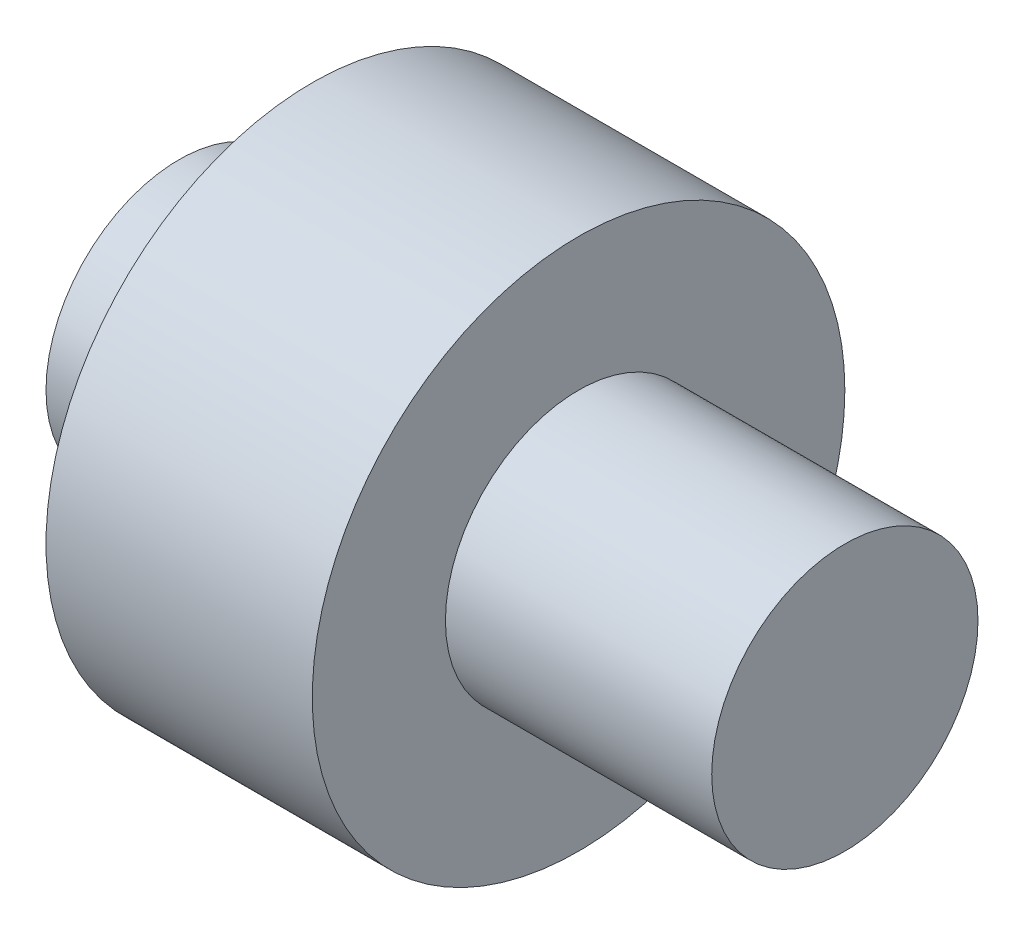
ISO-10303-21;
HEADER;
FILE_DESCRIPTION(('STEP AP214'),'2;1');
FILE_NAME('part.step','',(''),(''),'','','');
FILE_SCHEMA(('AUTOMOTIVE_DESIGN { 1 0 10303 214 1 1 1 1 }'));
ENDSEC;
DATA;
#1=APPLICATION_CONTEXT('core data for automotive mechanical design processes');
#2=APPLICATION_PROTOCOL_DEFINITION('international standard','automotive_design',2000,#1);
#3=PRODUCT_CONTEXT('',#1,'mechanical');
#4=PRODUCT('Part','Part','',(#3));
#5=PRODUCT_RELATED_PRODUCT_CATEGORY('part','',(#4));
#6=PRODUCT_DEFINITION_FORMATION('','',#4);
#7=PRODUCT_DEFINITION_CONTEXT('part definition',#1,'design');
#8=PRODUCT_DEFINITION('design','',#6,#7);
#9=PRODUCT_DEFINITION_SHAPE('','',#8);
#10=(LENGTH_UNIT() NAMED_UNIT(*) SI_UNIT(.MILLI.,.METRE.));
#11=(NAMED_UNIT(*) PLANE_ANGLE_UNIT() SI_UNIT($,.RADIAN.));
#12=(NAMED_UNIT(*) SI_UNIT($,.STERADIAN.) SOLID_ANGLE_UNIT());
#13=UNCERTAINTY_MEASURE_WITH_UNIT(LENGTH_MEASURE(1.E-05),#10,'distance_accuracy_value','');
#14=(GEOMETRIC_REPRESENTATION_CONTEXT(3) GLOBAL_UNCERTAINTY_ASSIGNED_CONTEXT((#13)) GLOBAL_UNIT_ASSIGNED_CONTEXT((#10,
#11,#12)) REPRESENTATION_CONTEXT('',''));
#15=CARTESIAN_POINT('',(0.,0.,0.));
#16=DIRECTION('',(0.,0.,1.));
#17=DIRECTION('',(1.,0.,0.));
#18=AXIS2_PLACEMENT_3D('',#15,#16,#17);
#19=CARTESIAN_POINT('',(10.,0.,0.));
#20=DIRECTION('',(-1.,0.,0.));
#21=DIRECTION('',(0.,0.,1.));
#22=AXIS2_PLACEMENT_3D('',#19,#20,#21);
#23=CYLINDRICAL_SURFACE('',#22,10.);
#24=CARTESIAN_POINT('',(10.,0.,0.));
#25=DIRECTION('',(1.,0.,0.));
#26=DIRECTION('',(0.,0.,-1.));
#27=AXIS2_PLACEMENT_3D('',#24,#25,#26);
#28=CIRCLE('',#27,10.);
#29=CARTESIAN_POINT('',(10.,0.,-10.));
#30=VERTEX_POINT('',#29);
#31=EDGE_CURVE('E36',#30,#30,#28,.T.);
#32=ORIENTED_EDGE('',*,*,#31,.F.);
#33=EDGE_LOOP('',(#32));
#34=FACE_BOUND('',#33,.T.);
#35=CARTESIAN_POINT('',(0.,0.,0.));
#36=DIRECTION('',(1.,0.,0.));
#37=DIRECTION('',(0.,0.,-1.));
#38=AXIS2_PLACEMENT_3D('',#35,#36,#37);
#39=CIRCLE('',#38,10.);
#40=CARTESIAN_POINT('',(0.,0.,-10.));
#41=VERTEX_POINT('',#40);
#42=EDGE_CURVE('E40',#41,#41,#39,.T.);
#43=ORIENTED_EDGE('',*,*,#42,.T.);
#44=EDGE_LOOP('',(#43));
#45=FACE_BOUND('',#44,.T.);
#46=ADVANCED_FACE('F30',(#34,#45),#23,.T.);
#47=CARTESIAN_POINT('',(10.,0.,0.));
#48=DIRECTION('',(1.,0.,0.));
#49=DIRECTION('',(0.,0.,-1.));
#50=AXIS2_PLACEMENT_3D('',#47,#48,#49);
#51=PLANE('',#50);
#52=CARTESIAN_POINT('',(10.,0.,0.));
#53=DIRECTION('',(1.,0.,0.));
#54=DIRECTION('',(0.,0.,-1.));
#55=AXIS2_PLACEMENT_3D('',#52,#53,#54);
#56=CIRCLE('',#55,5.);
#57=CARTESIAN_POINT('',(10.,0.,-5.));
#58=VERTEX_POINT('',#57);
#59=EDGE_CURVE('E50',#58,#58,#56,.T.);
#60=ORIENTED_EDGE('',*,*,#59,.F.);
#61=EDGE_LOOP('',(#60));
#62=FACE_BOUND('',#61,.T.);
#63=ORIENTED_EDGE('',*,*,#31,.T.);
#64=EDGE_LOOP('',(#63));
#65=FACE_BOUND('',#64,.T.);
#66=ADVANCED_FACE('F65',(#62,#65),#51,.T.);
#67=CARTESIAN_POINT('',(0.,0.,0.));
#68=DIRECTION('',(1.,0.,0.));
#69=DIRECTION('',(0.,0.,-1.));
#70=AXIS2_PLACEMENT_3D('',#67,#68,#69);
#71=PLANE('',#70);
#72=CARTESIAN_POINT('',(0.,0.,0.));
#73=DIRECTION('',(1.,0.,0.));
#74=DIRECTION('',(0.,0.,-1.));
#75=AXIS2_PLACEMENT_3D('',#72,#73,#74);
#76=CIRCLE('',#75,5.);
#77=CARTESIAN_POINT('',(0.,0.,-5.));
#78=VERTEX_POINT('',#77);
#79=EDGE_CURVE('E10',#78,#78,#76,.F.);
#80=ORIENTED_EDGE('',*,*,#79,.F.);
#81=EDGE_LOOP('',(#80));
#82=FACE_BOUND('',#81,.T.);
#83=ORIENTED_EDGE('',*,*,#42,.F.);
#84=EDGE_LOOP('',(#83));
#85=FACE_BOUND('',#84,.T.);
#86=ADVANCED_FACE('F67',(#82,#85),#71,.F.);
#87=CARTESIAN_POINT('',(-5.,0.,0.));
#88=DIRECTION('',(1.,0.,0.));
#89=DIRECTION('',(0.,0.,-1.));
#90=AXIS2_PLACEMENT_3D('',#87,#88,#89);
#91=CYLINDRICAL_SURFACE('',#90,5.);
#92=CARTESIAN_POINT('',(-5.,0.,0.));
#93=DIRECTION('',(-1.,0.,0.));
#94=DIRECTION('',(0.,0.,1.));
#95=AXIS2_PLACEMENT_3D('',#92,#93,#94);
#96=CIRCLE('',#95,5.);
#97=CARTESIAN_POINT('',(-5.,0.,5.));
#98=VERTEX_POINT('',#97);
#99=EDGE_CURVE('E45',#98,#98,#96,.T.);
#100=ORIENTED_EDGE('',*,*,#99,.F.);
#101=EDGE_LOOP('',(#100));
#102=FACE_BOUND('',#101,.T.);
#103=ORIENTED_EDGE('',*,*,#79,.T.);
#104=EDGE_LOOP('',(#103));
#105=FACE_BOUND('',#104,.T.);
#106=ADVANCED_FACE('F73',(#102,#105),#91,.T.);
#107=CARTESIAN_POINT('',(-5.,0.,0.));
#108=DIRECTION('',(-1.,0.,0.));
#109=DIRECTION('',(0.,0.,1.));
#110=AXIS2_PLACEMENT_3D('',#107,#108,#109);
#111=PLANE('',#110);
#112=ORIENTED_EDGE('',*,*,#99,.T.);
#113=EDGE_LOOP('',(#112));
#114=FACE_BOUND('',#113,.T.);
#115=ADVANCED_FACE('F61',(#114),#111,.T.);
#116=CARTESIAN_POINT('',(20.,0.,0.));
#117=DIRECTION('',(-1.,0.,0.));
#118=DIRECTION('',(0.,0.,1.));
#119=AXIS2_PLACEMENT_3D('',#116,#117,#118);
#120=CYLINDRICAL_SURFACE('',#119,5.);
#121=CARTESIAN_POINT('',(20.,0.,0.));
#122=DIRECTION('',(1.,0.,0.));
#123=DIRECTION('',(0.,0.,-1.));
#124=AXIS2_PLACEMENT_3D('',#121,#122,#123);
#125=CIRCLE('',#124,5.);
#126=CARTESIAN_POINT('',(20.,0.,-5.));
#127=VERTEX_POINT('',#126);
#128=EDGE_CURVE('E49',#127,#127,#125,.T.);
#129=ORIENTED_EDGE('',*,*,#128,.F.);
#130=EDGE_LOOP('',(#129));
#131=FACE_BOUND('',#130,.T.);
#132=ORIENTED_EDGE('',*,*,#59,.T.);
#133=EDGE_LOOP('',(#132));
#134=FACE_BOUND('',#133,.T.);
#135=ADVANCED_FACE('F58',(#131,#134),#120,.T.);
#136=CARTESIAN_POINT('',(20.,0.,0.));
#137=DIRECTION('',(1.,0.,0.));
#138=DIRECTION('',(0.,0.,-1.));
#139=AXIS2_PLACEMENT_3D('',#136,#137,#138);
#140=PLANE('',#139);
#141=ORIENTED_EDGE('',*,*,#128,.T.);
#142=EDGE_LOOP('',(#141));
#143=FACE_BOUND('',#142,.T.);
#144=ADVANCED_FACE('F56',(#143),#140,.T.);
#145=CLOSED_SHELL('',(#46,#66,#86,#106,#115,#135,#144));
#146=MANIFOLD_SOLID_BREP('B2',#145);
#147=ADVANCED_BREP_SHAPE_REPRESENTATION('',(#18,#146),#14);
#148=SHAPE_DEFINITION_REPRESENTATION(#9,#147);
ENDSEC;
END-ISO-10303-21;
